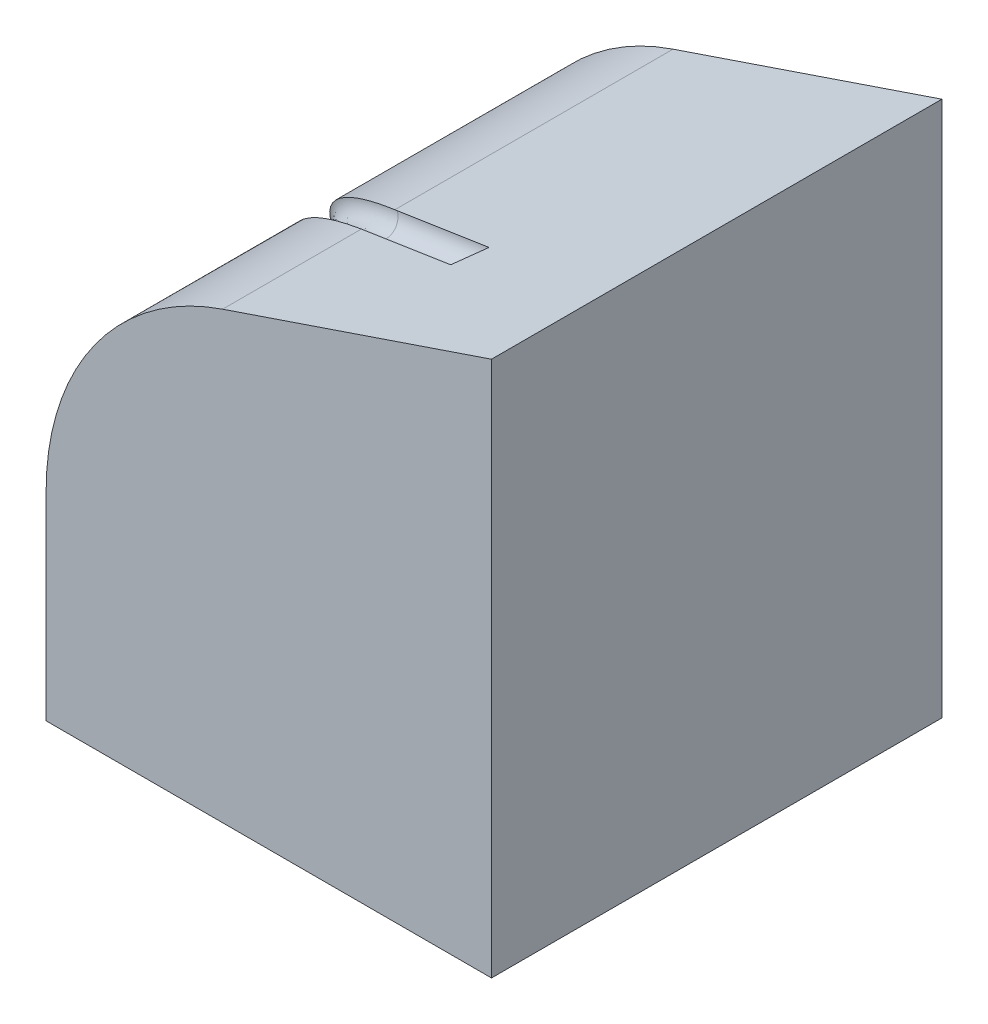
ISO-10303-21;
HEADER;
FILE_DESCRIPTION(('STEP AP214'),'2;1');
FILE_NAME('part.step','',(''),(''),'','','');
FILE_SCHEMA(('AUTOMOTIVE_DESIGN { 1 0 10303 214 1 1 1 1 }'));
ENDSEC;
DATA;
#1=APPLICATION_CONTEXT('core data for automotive mechanical design processes');
#2=APPLICATION_PROTOCOL_DEFINITION('international standard','automotive_design',2000,#1);
#3=PRODUCT_CONTEXT('',#1,'mechanical');
#4=PRODUCT('Part','Part','',(#3));
#5=PRODUCT_RELATED_PRODUCT_CATEGORY('part','',(#4));
#6=PRODUCT_DEFINITION_FORMATION('','',#4);
#7=PRODUCT_DEFINITION_CONTEXT('part definition',#1,'design');
#8=PRODUCT_DEFINITION('design','',#6,#7);
#9=PRODUCT_DEFINITION_SHAPE('','',#8);
#10=(LENGTH_UNIT() NAMED_UNIT(*) SI_UNIT(.MILLI.,.METRE.));
#11=(NAMED_UNIT(*) PLANE_ANGLE_UNIT() SI_UNIT($,.RADIAN.));
#12=(NAMED_UNIT(*) SI_UNIT($,.STERADIAN.) SOLID_ANGLE_UNIT());
#13=UNCERTAINTY_MEASURE_WITH_UNIT(LENGTH_MEASURE(1.E-05),#10,'distance_accuracy_value','');
#14=(GEOMETRIC_REPRESENTATION_CONTEXT(3) GLOBAL_UNCERTAINTY_ASSIGNED_CONTEXT((#13)) GLOBAL_UNIT_ASSIGNED_CONTEXT((#10,
#11,#12)) REPRESENTATION_CONTEXT('',''));
#15=CARTESIAN_POINT('',(0.,0.,0.));
#16=DIRECTION('',(0.,0.,1.));
#17=DIRECTION('',(1.,0.,0.));
#18=AXIS2_PLACEMENT_3D('',#15,#16,#17);
#19=CARTESIAN_POINT('',(-7.12892067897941,26.3531440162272,109.9));
#20=DIRECTION('',(0.,0.,-1.));
#21=DIRECTION('',(-1.,0.,0.));
#22=AXIS2_PLACEMENT_3D('',#19,#20,#21);
#23=CYLINDRICAL_SURFACE('',#22,63.4294971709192);
#24=CARTESIAN_POINT('',(-70.5562406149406,26.8786885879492,37.5910582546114));
#25=CARTESIAN_POINT('',(-70.5569664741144,26.7911047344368,37.5794543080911));
#26=CARTESIAN_POINT('',(-70.5575108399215,26.7035007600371,37.568000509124));
#27=CARTESIAN_POINT('',(-70.5582365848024,26.5282525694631,37.5453932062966));
#28=CARTESIAN_POINT('',(-70.5584179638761,26.4406083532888,37.5342397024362));
#29=CARTESIAN_POINT('',(-70.5584178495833,26.3529440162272,37.5232363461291));
#30=B_SPLINE_CURVE_WITH_KNOTS('',3,(#24,#25,#26,#27,#28,#29),.UNSPECIFIED.,.F.,.F.,(4,2,4),(0.,
0.265053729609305,0.530107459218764),.UNSPECIFIED.);
#31=CARTESIAN_POINT('',(-70.556242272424,26.8784885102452,37.5910317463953));
#32=VERTEX_POINT('',#31);
#33=CARTESIAN_POINT('',(-70.5584178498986,26.3531440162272,37.5232614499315));
#34=VERTEX_POINT('',#33);
#35=EDGE_CURVE('E165',#32,#34,#30,.T.);
#36=ORIENTED_EDGE('',*,*,#35,.F.);
#37=CARTESIAN_POINT('',(-70.556242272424,26.8784885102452,37.5910317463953));
#38=CARTESIAN_POINT('',(-70.5535150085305,27.2078099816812,37.6346610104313));
#39=CARTESIAN_POINT('',(-70.5482243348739,27.5368326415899,37.6803212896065));
#40=CARTESIAN_POINT('',(-70.5325472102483,28.1941577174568,37.7757690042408));
#41=CARTESIAN_POINT('',(-70.5221607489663,28.522460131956,37.8255564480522));
#42=CARTESIAN_POINT('',(-70.4834066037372,29.5060420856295,37.9811976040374));
#43=CARTESIAN_POINT('',(-70.4474436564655,30.160055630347,38.0933379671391));
#44=CARTESIAN_POINT('',(-70.3556155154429,31.4631990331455,38.3344926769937));
#45=CARTESIAN_POINT('',(-70.2997602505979,32.1123311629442,38.4634985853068));
#46=CARTESIAN_POINT('',(-70.1685398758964,33.4050670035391,38.7382222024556));
#47=CARTESIAN_POINT('',(-70.0931746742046,34.0486706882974,38.8839399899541));
#48=CARTESIAN_POINT('',(-69.9233976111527,35.3293311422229,39.1914952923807));
#49=CARTESIAN_POINT('',(-69.8289896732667,35.9663892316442,39.3533294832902));
#50=CARTESIAN_POINT('',(-69.6216007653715,37.2333129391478,39.6924932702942));
#51=CARTESIAN_POINT('',(-69.5086197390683,37.8631785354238,39.8698229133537));
#52=CARTESIAN_POINT('',(-69.2645956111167,39.1150291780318,40.239369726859));
#53=CARTESIAN_POINT('',(-69.1335513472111,39.7370137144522,40.4315878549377));
#54=CARTESIAN_POINT('',(-68.8539622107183,40.9723574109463,40.8305175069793));
#55=CARTESIAN_POINT('',(-68.705417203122,41.5857165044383,41.0372291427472));
#56=CARTESIAN_POINT('',(-68.4623953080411,42.5279608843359,41.3682056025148));
#57=CARTESIAN_POINT('',(-68.3738232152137,42.8601326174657,41.4875105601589));
#58=CARTESIAN_POINT('',(-68.191713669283,43.5215479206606,41.7303736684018));
#59=CARTESIAN_POINT('',(-68.0981761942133,43.8507914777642,41.8539318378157));
#60=CARTESIAN_POINT('',(-67.8102572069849,44.8340239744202,42.2307569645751));
#61=CARTESIAN_POINT('',(-67.6085625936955,45.4835400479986,42.490183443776));
#62=CARTESIAN_POINT('',(-67.1865017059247,46.7699644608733,43.0251643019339));
#63=CARTESIAN_POINT('',(-66.966129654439,47.4068688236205,43.3007236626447));
#64=CARTESIAN_POINT('',(-66.5075899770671,48.6673660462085,43.8670580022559));
#65=CARTESIAN_POINT('',(-66.2694221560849,49.2909587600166,44.1578331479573));
#66=CARTESIAN_POINT('',(-65.7294783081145,50.6409920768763,44.8101930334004));
#67=CARTESIAN_POINT('',(-65.4241902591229,51.3645838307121,45.1747705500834));
#68=CARTESIAN_POINT('',(-64.7909806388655,52.7917010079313,45.9232005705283));
#69=CARTESIAN_POINT('',(-64.4630573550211,53.4952249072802,46.3070545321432));
#70=CARTESIAN_POINT('',(-63.9554969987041,54.5345193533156,46.8967808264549));
#71=CARTESIAN_POINT('',(-63.783751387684,54.8781851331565,47.0956188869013));
#72=CARTESIAN_POINT('',(-63.4351609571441,55.5602506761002,47.497826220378));
#73=CARTESIAN_POINT('',(-63.2583160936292,55.8986503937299,47.7011955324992));
#74=CARTESIAN_POINT('',(-62.8997135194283,56.5701034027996,48.1122245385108));
#75=CARTESIAN_POINT('',(-62.7179566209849,56.9031575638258,48.3198835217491));
#76=CARTESIAN_POINT('',(-62.3496298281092,57.5639986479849,48.7392534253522));
#77=CARTESIAN_POINT('',(-62.163060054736,57.8917857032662,48.9509642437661));
#78=CARTESIAN_POINT('',(-61.9741431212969,58.2169587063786,49.1645708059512));
#79=B_SPLINE_CURVE_WITH_KNOTS('',3,(#37,#38,#39,#40,#41,#42,#43,#44,#45,#46,#47,#48,#49,#50,#51,
#52,#53,#54,#55,#56,#57,#58,#59,#60,#61,#62,#63,#64,#65,#66,#67,#68,#69,#70,#71,#72,#73,#74,#75,
#76,#77,#78),.UNSPECIFIED.,.F.,.F.,(4,2,2,2,2,2,2,2,2,2,2,2,2,2,2,2,2,2,2,2,4),(0.,
0.996597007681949,1.99319603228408,3.98621477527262,5.9782401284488,7.97027485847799,
9.96189957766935,11.9535303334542,13.9452892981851,15.9370636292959,17.0286740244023,
18.1202892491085,20.3034369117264,22.4872623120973,24.6711116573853,27.2679014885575,
29.8648880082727,31.1626046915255,32.4603325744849,33.7578471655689,35.0553291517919),.UNSPECIFIED.);
#80=CARTESIAN_POINT('',(-61.9741431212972,58.2169587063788,49.1645708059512));
#81=VERTEX_POINT('',#80);
#82=EDGE_CURVE('E158',#32,#81,#79,.T.);
#83=ORIENTED_EDGE('',*,*,#82,.T.);
#84=CARTESIAN_POINT('',(-61.9741431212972,58.2169587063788,49.1645708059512));
#85=CARTESIAN_POINT('',(-61.3929715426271,59.2172988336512,49.8216231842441));
#86=CARTESIAN_POINT('',(-60.7822696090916,60.2054475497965,50.4712952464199));
#87=CARTESIAN_POINT('',(-59.5019323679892,62.1543780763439,51.753885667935));
#88=CARTESIAN_POINT('',(-58.8322859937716,63.1151547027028,52.3868008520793));
#89=CARTESIAN_POINT('',(-57.4343356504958,65.0060734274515,53.6336984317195));
#90=CARTESIAN_POINT('',(-56.7060257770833,65.9362124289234,54.2476789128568));
#91=CARTESIAN_POINT('',(-55.1912057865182,67.762383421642,55.4541406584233));
#92=CARTESIAN_POINT('',(-54.4046983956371,68.658417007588,56.0466229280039));
#93=CARTESIAN_POINT('',(-52.7738826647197,70.4130293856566,57.2077718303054));
#94=CARTESIAN_POINT('',(-51.9295605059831,71.2715991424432,57.7764327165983));
#95=CARTESIAN_POINT('',(-50.1841426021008,72.9472672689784,58.8874196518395));
#96=CARTESIAN_POINT('',(-49.2830469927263,73.7643657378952,59.4297457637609));
#97=CARTESIAN_POINT('',(-47.8897635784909,74.9559066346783,60.22133524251));
#98=CARTESIAN_POINT('',(-47.4183086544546,75.3474687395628,60.4815925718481));
#99=CARTESIAN_POINT('',(-46.4616790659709,76.1187213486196,60.9944162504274));
#100=CARTESIAN_POINT('',(-45.9765044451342,76.4984118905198,61.2469826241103));
#101=CARTESIAN_POINT('',(-44.9925961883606,77.2454292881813,61.7439926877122));
#102=CARTESIAN_POINT('',(-44.4938617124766,77.6127553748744,61.9884358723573));
#103=CARTESIAN_POINT('',(-43.4831365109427,78.3344661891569,62.4687841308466));
#104=CARTESIAN_POINT('',(-42.9711456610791,78.6888507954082,62.7046891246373));
#105=CARTESIAN_POINT('',(-41.3308510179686,79.7886393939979,63.4370845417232));
#106=CARTESIAN_POINT('',(-40.1784261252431,80.5093577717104,63.9174838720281));
#107=CARTESIAN_POINT('',(-38.4071877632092,81.5386305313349,64.6045392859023));
#108=CARTESIAN_POINT('',(-37.8096503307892,81.8730995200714,64.8279753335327));
#109=CARTESIAN_POINT('',(-36.6007205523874,82.5241802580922,65.2632459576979));
#110=CARTESIAN_POINT('',(-35.9893281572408,82.8407919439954,65.4750804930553));
#111=CARTESIAN_POINT('',(-34.740346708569,83.4618722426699,65.8908341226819));
#112=CARTESIAN_POINT('',(-34.1024772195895,83.7659492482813,66.0944955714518));
#113=CARTESIAN_POINT('',(-32.8134927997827,84.3540551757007,66.4884046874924));
#114=CARTESIAN_POINT('',(-32.1623780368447,84.6380843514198,66.67865252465));
#115=CARTESIAN_POINT('',(-30.8472834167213,85.1855144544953,67.045253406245));
#116=CARTESIAN_POINT('',(-30.183297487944,85.4489053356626,67.2215996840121));
#117=CARTESIAN_POINT('',(-28.8435601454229,85.9542218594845,67.5599605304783));
#118=CARTESIAN_POINT('',(-28.167807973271,86.1961461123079,67.7219741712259));
#119=CARTESIAN_POINT('',(-27.4866125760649,86.4269776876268,67.8766426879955));
#120=B_SPLINE_CURVE_WITH_KNOTS('',3,(#84,#85,#86,#87,#88,#89,#90,#91,#92,#93,#94,#95,#96,#97,
#98,#99,#100,#101,#102,#103,#104,#105,#106,#107,#108,#109,#110,#111,#112,#113,#114,#115,#116,
#117,#118,#119),.UNSPECIFIED.,.F.,.F.,(4,2,2,2,2,2,2,2,2,2,2,2,2,2,2,2,2,4),(0.,
3.99114734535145,7.98304562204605,11.9753461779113,15.967459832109,19.9605310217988,
23.9535926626,25.9508305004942,27.9480619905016,29.9454174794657,31.9427916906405,
36.263626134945,38.4242142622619,40.5848100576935,42.7905212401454,44.9962044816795,
47.2029548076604,49.409847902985),.UNSPECIFIED.);
#121=CARTESIAN_POINT('',(-27.4866125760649,86.4269776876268,67.8766426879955));
#122=VERTEX_POINT('',#121);
#123=EDGE_CURVE('E77',#81,#122,#120,.T.);
#124=ORIENTED_EDGE('',*,*,#123,.T.);
#125=DIRECTION('',(0.,0.,-1.));
#126=VECTOR('',#125,1.);
#127=CARTESIAN_POINT('',(-27.4866125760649,86.4269776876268,109.9));
#128=LINE('',#127,#126);
#129=CARTESIAN_POINT('',(-27.4866125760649,86.4269776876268,0.));
#130=VERTEX_POINT('',#129);
#131=EDGE_CURVE('E285',#122,#130,#128,.T.);
#132=ORIENTED_EDGE('',*,*,#131,.T.);
#133=CARTESIAN_POINT('',(-7.12892067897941,26.3531440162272,0.));
#134=DIRECTION('',(0.,0.,1.));
#135=DIRECTION('',(-1.,0.,0.));
#136=AXIS2_PLACEMENT_3D('',#133,#134,#135);
#137=CIRCLE('',#136,63.4294971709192);
#138=CARTESIAN_POINT('',(-70.5584178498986,26.3531440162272,0.));
#139=VERTEX_POINT('',#138);
#140=EDGE_CURVE('E322',#130,#139,#137,.T.);
#141=ORIENTED_EDGE('',*,*,#140,.T.);
#142=DIRECTION('',(0.,0.,-1.));
#143=VECTOR('',#142,1.);
#144=CARTESIAN_POINT('',(-70.5584178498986,26.3531440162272,109.9));
#145=LINE('',#144,#143);
#146=EDGE_CURVE('E180',#34,#139,#145,.T.);
#147=ORIENTED_EDGE('',*,*,#146,.F.);
#148=EDGE_LOOP('',(#36,#83,#124,#132,#141,#147));
#149=FACE_BOUND('',#148,.T.);
#150=ADVANCED_FACE('F69',(#149),#23,.T.);
#151=CARTESIAN_POINT('',(-70.5584178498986,-22.1026369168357,109.9));
#152=DIRECTION('',(1.,0.,0.));
#153=DIRECTION('',(0.,0.,-1.));
#154=AXIS2_PLACEMENT_3D('',#151,#152,#153);
#155=PLANE('',#154);
#156=CARTESIAN_POINT('',(-70.5584178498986,16.7215789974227,114.256365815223));
#157=DIRECTION('',(1.,0.,0.));
#158=DIRECTION('',(0.,0.,-1.));
#159=AXIS2_PLACEMENT_3D('',#156,#157,#158);
#160=CIRCLE('',#159,77.3352206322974);
#161=CARTESIAN_POINT('',(-70.5584178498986,-10.7953679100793,41.9822073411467));
#162=VERTEX_POINT('',#161);
#163=EDGE_CURVE('E306',#34,#162,#160,.F.);
#164=ORIENTED_EDGE('',*,*,#163,.F.);
#165=ORIENTED_EDGE('',*,*,#146,.T.);
#166=DIRECTION('',(0.,-1.,0.));
#167=VECTOR('',#166,1.);
#168=CARTESIAN_POINT('',(-70.5584178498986,-22.1026369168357,0.));
#169=LINE('',#168,#167);
#170=CARTESIAN_POINT('',(-70.5584178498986,-22.1026369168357,0.));
#171=VERTEX_POINT('',#170);
#172=EDGE_CURVE('E324',#139,#171,#169,.T.);
#173=ORIENTED_EDGE('',*,*,#172,.T.);
#174=DIRECTION('',(0.,0.,-1.));
#175=VECTOR('',#174,1.);
#176=CARTESIAN_POINT('',(-70.5584178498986,-22.1026369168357,109.9));
#177=LINE('',#176,#175);
#178=CARTESIAN_POINT('',(-70.5584178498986,-22.1026369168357,109.9));
#179=VERTEX_POINT('',#178);
#180=EDGE_CURVE('E334',#179,#171,#177,.T.);
#181=ORIENTED_EDGE('',*,*,#180,.F.);
#182=DIRECTION('',(0.,-1.,0.));
#183=VECTOR('',#182,1.);
#184=CARTESIAN_POINT('',(-70.5584178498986,-22.1026369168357,109.9));
#185=LINE('',#184,#183);
#186=CARTESIAN_POINT('',(-70.5584178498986,26.3531440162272,109.9));
#187=VERTEX_POINT('',#186);
#188=EDGE_CURVE('E92',#187,#179,#185,.T.);
#189=ORIENTED_EDGE('',*,*,#188,.F.);
#190=CARTESIAN_POINT('',(-70.5584178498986,26.3531440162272,45.5931771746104));
#191=VERTEX_POINT('',#190);
#192=EDGE_CURVE('E291',#187,#191,#145,.T.);
#193=ORIENTED_EDGE('',*,*,#192,.T.);
#194=CARTESIAN_POINT('',(-70.5584178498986,26.3531440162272,45.5931771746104));
#195=CARTESIAN_POINT('',(-70.5584178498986,26.2656278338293,45.580966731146));
#196=CARTESIAN_POINT('',(-70.5584178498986,26.1780910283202,45.568907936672));
#197=CARTESIAN_POINT('',(-70.5584178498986,26.0029761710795,45.5450936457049));
#198=CARTESIAN_POINT('',(-70.5584178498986,25.915398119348,45.5333381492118));
#199=CARTESIAN_POINT('',(-70.5584178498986,25.8277994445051,45.521734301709));
#200=B_SPLINE_CURVE_WITH_KNOTS('',3,(#194,#195,#196,#197,#198,#199),.UNSPECIFIED.,.F.,.F.,(4,2,
4),(0.,0.265090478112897,0.530180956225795),.UNSPECIFIED.);
#201=CARTESIAN_POINT('',(-70.5584178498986,25.8277994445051,45.521734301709));
#202=VERTEX_POINT('',#201);
#203=EDGE_CURVE('E259',#191,#202,#200,.T.);
#204=ORIENTED_EDGE('',*,*,#203,.T.);
#205=CARTESIAN_POINT('',(-70.5584178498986,16.7215789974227,114.256365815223));
#206=DIRECTION('',(-1.,0.,0.));
#207=DIRECTION('',(0.,0.,1.));
#208=AXIS2_PLACEMENT_3D('',#205,#206,#207);
#209=CIRCLE('',#208,69.3352206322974);
#210=CARTESIAN_POINT('',(-70.5584178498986,-7.94885666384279,49.4586619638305));
#211=VERTEX_POINT('',#210);
#212=EDGE_CURVE('E173',#211,#202,#209,.F.);
#213=ORIENTED_EDGE('',*,*,#212,.F.);
#214=DIRECTION('',(0.,0.355813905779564,0.934556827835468));
#215=VECTOR('',#214,1.);
#216=CARTESIAN_POINT('',(-70.5584178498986,10.3576810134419,97.541380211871));
#217=LINE('',#216,#215);
#218=EDGE_CURVE('E305',#162,#211,#217,.T.);
#219=ORIENTED_EDGE('',*,*,#218,.F.);
#220=EDGE_LOOP('',(#164,#165,#173,#181,#189,#193,#204,#213,#219));
#221=FACE_BOUND('',#220,.T.);
#222=ADVANCED_FACE('F339',(#221),#155,.F.);
#223=CARTESIAN_POINT('',(38.1192817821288,-22.1026369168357,109.9));
#224=DIRECTION('',(0.,1.,0.));
#225=DIRECTION('',(0.,0.,1.));
#226=AXIS2_PLACEMENT_3D('',#223,#224,#225);
#227=PLANE('',#226);
#228=DIRECTION('',(1.,0.,0.));
#229=VECTOR('',#228,1.);
#230=CARTESIAN_POINT('',(38.1192817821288,-22.1026369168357,0.));
#231=LINE('',#230,#229);
#232=CARTESIAN_POINT('',(38.1192817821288,-22.1026369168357,0.));
#233=VERTEX_POINT('',#232);
#234=EDGE_CURVE('E315',#171,#233,#231,.T.);
#235=ORIENTED_EDGE('',*,*,#234,.T.);
#236=DIRECTION('',(0.,0.,-1.));
#237=VECTOR('',#236,1.);
#238=CARTESIAN_POINT('',(38.1192817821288,-22.1026369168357,109.9));
#239=LINE('',#238,#237);
#240=CARTESIAN_POINT('',(38.1192817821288,-22.1026369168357,109.9));
#241=VERTEX_POINT('',#240);
#242=EDGE_CURVE('E299',#241,#233,#239,.T.);
#243=ORIENTED_EDGE('',*,*,#242,.F.);
#244=DIRECTION('',(1.,0.,0.));
#245=VECTOR('',#244,1.);
#246=CARTESIAN_POINT('',(38.1192817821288,-22.1026369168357,109.9));
#247=LINE('',#246,#245);
#248=EDGE_CURVE('E326',#179,#241,#247,.T.);
#249=ORIENTED_EDGE('',*,*,#248,.F.);
#250=ORIENTED_EDGE('',*,*,#180,.T.);
#251=EDGE_LOOP('',(#235,#243,#249,#250));
#252=FACE_BOUND('',#251,.T.);
#253=ADVANCED_FACE('F71',(#252),#227,.F.);
#254=CARTESIAN_POINT('',(38.1192817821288,108.659362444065,109.9));
#255=DIRECTION('',(-1.,0.,0.));
#256=DIRECTION('',(0.,0.,1.));
#257=AXIS2_PLACEMENT_3D('',#254,#255,#256);
#258=PLANE('',#257);
#259=DIRECTION('',(0.,1.,0.));
#260=VECTOR('',#259,1.);
#261=CARTESIAN_POINT('',(38.1192817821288,108.659362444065,0.));
#262=LINE('',#261,#260);
#263=CARTESIAN_POINT('',(38.1192817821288,108.659362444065,0.));
#264=VERTEX_POINT('',#263);
#265=EDGE_CURVE('E319',#233,#264,#262,.T.);
#266=ORIENTED_EDGE('',*,*,#265,.T.);
#267=DIRECTION('',(0.,0.,-1.));
#268=VECTOR('',#267,1.);
#269=CARTESIAN_POINT('',(38.1192817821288,108.659362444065,109.9));
#270=LINE('',#269,#268);
#271=CARTESIAN_POINT('',(38.1192817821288,108.659362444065,109.9));
#272=VERTEX_POINT('',#271);
#273=EDGE_CURVE('E294',#272,#264,#270,.T.);
#274=ORIENTED_EDGE('',*,*,#273,.F.);
#275=DIRECTION('',(0.,1.,0.));
#276=VECTOR('',#275,1.);
#277=CARTESIAN_POINT('',(38.1192817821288,108.659362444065,109.9));
#278=LINE('',#277,#276);
#279=EDGE_CURVE('E328',#241,#272,#278,.T.);
#280=ORIENTED_EDGE('',*,*,#279,.F.);
#281=ORIENTED_EDGE('',*,*,#242,.T.);
#282=EDGE_LOOP('',(#266,#274,#280,#281));
#283=FACE_BOUND('',#282,.T.);
#284=ADVANCED_FACE('F345',(#283),#258,.F.);
#285=CARTESIAN_POINT('',(-27.4866125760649,86.4269776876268,109.9));
#286=DIRECTION('',(0.320949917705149,-0.947096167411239,0.));
#287=DIRECTION('',(0.947096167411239,0.320949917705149,0.));
#288=AXIS2_PLACEMENT_3D('',#285,#286,#287);
#289=PLANE('',#288);
#290=DIRECTION('',(-0.19213374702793,-0.0651098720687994,0.979206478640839));
#291=VECTOR('',#290,1.);
#292=CARTESIAN_POINT('',(-5.96550755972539,93.7200035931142,114.607667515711));
#293=LINE('',#292,#291);
#294=CARTESIAN_POINT('',(1.94010361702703,96.3990401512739,74.3168503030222));
#295=VERTEX_POINT('',#294);
#296=CARTESIAN_POINT('',(0.403033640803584,95.8781611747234,82.1505021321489));
#297=VERTEX_POINT('',#296);
#298=EDGE_CURVE('E12',#295,#297,#293,.T.);
#299=ORIENTED_EDGE('',*,*,#298,.T.);
#300=DIRECTION('',(0.927402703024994,0.314276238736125,0.20286614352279));
#301=VECTOR('',#300,1.);
#302=CARTESIAN_POINT('',(-28.2551475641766,86.1665381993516,75.881623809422));
#303=LINE('',#302,#301);
#304=CARTESIAN_POINT('',(-27.4866125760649,86.4269776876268,76.049738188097));
#305=VERTEX_POINT('',#304);
#306=EDGE_CURVE('E184',#297,#305,#303,.F.);
#307=ORIENTED_EDGE('',*,*,#306,.T.);
#308=CARTESIAN_POINT('',(-27.4866125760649,86.4269776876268,109.9));
#309=VERTEX_POINT('',#308);
#310=EDGE_CURVE('E290',#309,#305,#128,.T.);
#311=ORIENTED_EDGE('',*,*,#310,.F.);
#312=DIRECTION('',(-0.947096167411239,-0.320949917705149,0.));
#313=VECTOR('',#312,1.);
#314=CARTESIAN_POINT('',(-27.4866125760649,86.4269776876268,109.9));
#315=LINE('',#314,#313);
#316=EDGE_CURVE('E330',#272,#309,#315,.T.);
#317=ORIENTED_EDGE('',*,*,#316,.F.);
#318=ORIENTED_EDGE('',*,*,#273,.T.);
#319=DIRECTION('',(-0.947096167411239,-0.320949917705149,0.));
#320=VECTOR('',#319,1.);
#321=CARTESIAN_POINT('',(-27.4866125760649,86.4269776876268,0.));
#322=LINE('',#321,#320);
#323=EDGE_CURVE('E288',#264,#130,#322,.T.);
#324=ORIENTED_EDGE('',*,*,#323,.T.);
#325=ORIENTED_EDGE('',*,*,#131,.F.);
#326=CARTESIAN_POINT('',(-27.4866125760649,86.4269776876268,67.8766426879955));
#327=CARTESIAN_POINT('',(-27.3586260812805,86.4703494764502,67.9057110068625));
#328=CARTESIAN_POINT('',(-27.2305882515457,86.5137386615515,67.934522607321));
#329=CARTESIAN_POINT('',(-26.9744099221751,86.6005518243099,67.9916323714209));
#330=CARTESIAN_POINT('',(-26.8462694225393,86.643975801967,68.0199305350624));
#331=CARTESIAN_POINT('',(-26.7180775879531,86.687417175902,68.0479719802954));
#332=B_SPLINE_CURVE_WITH_KNOTS('',3,(#326,#327,#328,#329,#330,#331),.UNSPECIFIED.,.F.,.F.,(4,2,
4),(0.,0.414677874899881,0.829355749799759),.UNSPECIFIED.);
#333=CARTESIAN_POINT('',(-26.7180775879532,86.687417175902,68.0479719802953));
#334=VERTEX_POINT('',#333);
#335=EDGE_CURVE('E181',#122,#334,#332,.T.);
#336=ORIENTED_EDGE('',*,*,#335,.T.);
#337=DIRECTION('',(0.927402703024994,0.314276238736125,0.20286614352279));
#338=VECTOR('',#337,1.);
#339=CARTESIAN_POINT('',(-26.7180775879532,86.687417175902,68.0479719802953));
#340=LINE('',#339,#338);
#341=EDGE_CURVE('E283',#334,#295,#340,.T.);
#342=ORIENTED_EDGE('',*,*,#341,.T.);
#343=EDGE_LOOP('',(#299,#307,#311,#317,#318,#324,#325,#336,#342));
#344=FACE_BOUND('',#343,.T.);
#345=ADVANCED_FACE('F282',(#344),#289,.F.);
#346=ORIENTED_EDGE('',*,*,#310,.T.);
#347=CARTESIAN_POINT('',(-27.4866125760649,86.4269776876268,76.049738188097));
#348=CARTESIAN_POINT('',(-27.6147068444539,86.3835693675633,76.0217184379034));
#349=CARTESIAN_POINT('',(-27.7426596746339,86.3397522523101,75.9936987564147));
#350=CARTESIAN_POINT('',(-27.998282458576,86.2513004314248,75.9376595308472));
#351=CARTESIAN_POINT('',(-28.1259524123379,86.2066657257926,75.9096399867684));
#352=CARTESIAN_POINT('',(-28.253480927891,86.1616222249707,75.8816205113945));
#353=B_SPLINE_CURVE_WITH_KNOTS('',3,(#347,#348,#349,#350,#351,#352),.UNSPECIFIED.,.F.,.F.,(4,2,
4),(0.,0.414358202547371,0.828716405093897),.UNSPECIFIED.);
#354=CARTESIAN_POINT('',(-28.253480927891,86.1616222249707,75.8816205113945));
#355=VERTEX_POINT('',#354);
#356=EDGE_CURVE('E220',#305,#355,#353,.T.);
#357=ORIENTED_EDGE('',*,*,#356,.T.);
#358=CARTESIAN_POINT('',(-28.2534809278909,86.1616222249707,75.8816205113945));
#359=CARTESIAN_POINT('',(-28.5611136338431,86.052965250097,75.8140249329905));
#360=CARTESIAN_POINT('',(-28.867605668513,85.9420415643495,75.7449204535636));
#361=CARTESIAN_POINT('',(-29.4782531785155,85.71571202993,75.6038031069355));
#362=CARTESIAN_POINT('',(-29.7824086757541,85.6003062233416,75.5317902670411));
#363=CARTESIAN_POINT('',(-30.6912218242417,85.2474682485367,75.3115693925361));
#364=CARTESIAN_POINT('',(-31.2923016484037,85.003388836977,75.159162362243));
#365=CARTESIAN_POINT('',(-32.4843003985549,84.4980051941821,74.8437998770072));
#366=CARTESIAN_POINT('',(-33.0752199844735,84.2367020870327,74.6808451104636));
#367=CARTESIAN_POINT('',(-34.2464528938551,83.6973353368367,74.3447499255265));
#368=CARTESIAN_POINT('',(-34.8267655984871,83.4192707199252,74.1716089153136));
#369=CARTESIAN_POINT('',(-36.158689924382,82.7560603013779,73.7588333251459));
#370=CARTESIAN_POINT('',(-36.9062054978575,82.3649413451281,73.5155372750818));
#371=CARTESIAN_POINT('',(-38.3806338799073,81.5558504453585,73.0117316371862));
#372=CARTESIAN_POINT('',(-39.1075458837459,81.1378774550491,72.7512213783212));
#373=CARTESIAN_POINT('',(-40.5399356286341,80.2762732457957,72.2136098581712));
#374=CARTESIAN_POINT('',(-41.2454086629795,79.83263645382,71.9365049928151));
#375=CARTESIAN_POINT('',(-42.6339448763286,78.9210442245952,71.3666437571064));
#376=CARTESIAN_POINT('',(-43.317008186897,78.4530889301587,71.0738874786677));
#377=CARTESIAN_POINT('',(-44.6594738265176,77.4945012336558,70.4738098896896));
#378=CARTESIAN_POINT('',(-45.3188951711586,77.0038878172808,70.1665007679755));
#379=CARTESIAN_POINT('',(-46.6141408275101,76.0007979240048,69.5379112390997));
#380=CARTESIAN_POINT('',(-47.2499625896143,75.4883190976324,69.2166293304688));
#381=CARTESIAN_POINT('',(-48.4973219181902,74.4428376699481,68.5609181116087));
#382=CARTESIAN_POINT('',(-49.1088626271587,73.9098377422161,68.22649051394));
#383=CARTESIAN_POINT('',(-50.3072844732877,72.8244642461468,67.5451140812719));
#384=CARTESIAN_POINT('',(-50.894165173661,72.2720903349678,67.19816502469));
#385=CARTESIAN_POINT('',(-52.0882262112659,71.104825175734,66.4645569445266));
#386=CARTESIAN_POINT('',(-52.6933507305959,70.4884413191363,66.0769254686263));
#387=CARTESIAN_POINT('',(-53.8740337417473,69.2359637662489,65.2886996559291));
#388=CARTESIAN_POINT('',(-54.4495918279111,68.5998697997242,64.8881051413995));
#389=CARTESIAN_POINT('',(-55.5709465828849,67.3092444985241,64.0746661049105));
#390=CARTESIAN_POINT('',(-56.1167366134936,66.6547091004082,63.6618188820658));
#391=CARTESIAN_POINT('',(-57.1781741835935,65.3287088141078,62.8247709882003));
#392=CARTESIAN_POINT('',(-57.6938218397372,64.6572439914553,62.4005703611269));
#393=CARTESIAN_POINT('',(-58.7226046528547,63.2609453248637,61.5180538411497));
#394=CARTESIAN_POINT('',(-59.2340204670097,62.5352148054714,61.0591493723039));
#395=CARTESIAN_POINT('',(-60.2230254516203,61.0677008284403,60.1308081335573));
#396=CARTESIAN_POINT('',(-60.7006131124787,60.3259166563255,59.6613708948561));
#397=CARTESIAN_POINT('',(-62.082008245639,58.0792779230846,58.2388588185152));
#398=CARTESIAN_POINT('',(-62.9352317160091,56.5520696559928,57.2709091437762));
#399=CARTESIAN_POINT('',(-63.7640410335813,54.9148980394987,56.2313137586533));
#400=CARTESIAN_POINT('',(-63.8078780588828,54.8278069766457,56.1760056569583));
#401=CARTESIAN_POINT('',(-63.8514991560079,54.7406448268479,56.1206465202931));
#402=B_SPLINE_CURVE_WITH_KNOTS('',3,(#358,#359,#360,#361,#362,#363,#364,#365,#366,#367,#368,
#369,#370,#371,#372,#373,#374,#375,#376,#377,#378,#379,#380,#381,#382,#383,#384,#385,#386,#387,
#388,#389,#390,#391,#392,#393,#394,#395,#396,#397,#398,#399,#400,#401),.UNSPECIFIED.,.F.,.F.,(4,
2,2,2,2,2,2,2,2,2,2,2,2,2,2,2,2,2,2,2,2,4),(0.,0.999532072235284,1.99905476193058,
3.9978548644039,5.99652464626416,7.99531066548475,10.6285521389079,13.2618963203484,
15.8958145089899,18.5297172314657,21.1614516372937,23.7934695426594,26.4251456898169,
29.0568684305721,31.896379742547,34.7359300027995,37.5761109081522,40.4162808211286,
43.41367921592,46.4112112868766,52.4018274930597,52.7381143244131),.UNSPECIFIED.);
#403=CARTESIAN_POINT('',(-63.8514991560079,54.7406448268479,56.1206465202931));
#404=VERTEX_POINT('',#403);
#405=EDGE_CURVE('E226',#355,#404,#402,.T.);
#406=ORIENTED_EDGE('',*,*,#405,.T.);
#407=CARTESIAN_POINT('',(-63.8514991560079,54.7406448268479,56.1206465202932));
#408=CARTESIAN_POINT('',(-63.9804792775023,54.4829216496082,55.9569592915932));
#409=CARTESIAN_POINT('',(-64.1080020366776,54.2237240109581,55.7944516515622));
#410=CARTESIAN_POINT('',(-64.3600873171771,53.7023403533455,55.4719439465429));
#411=CARTESIAN_POINT('',(-64.4846497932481,53.4401542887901,55.3119439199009));
#412=CARTESIAN_POINT('',(-64.8538290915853,52.6490524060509,54.8359270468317));
#413=CARTESIAN_POINT('',(-65.0939310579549,52.1156063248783,54.5239019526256));
#414=CARTESIAN_POINT('',(-65.5617013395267,51.0362829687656,53.9113538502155));
#415=CARTESIAN_POINT('',(-65.789361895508,50.4903982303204,53.6108380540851));
#416=CARTESIAN_POINT('',(-66.1208926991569,49.6627275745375,53.1692173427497));
#417=CARTESIAN_POINT('',(-66.2297439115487,49.3853608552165,53.0235346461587));
#418=CARTESIAN_POINT('',(-66.4440312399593,48.8277516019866,52.7351936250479));
#419=CARTESIAN_POINT('',(-66.5494673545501,48.5475090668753,52.5925353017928));
#420=CARTESIAN_POINT('',(-66.8606161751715,47.7022955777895,52.1690916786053));
#421=CARTESIAN_POINT('',(-67.0610866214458,47.1330450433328,51.8929478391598));
#422=CARTESIAN_POINT('',(-67.4474039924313,45.9834619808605,51.3538137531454));
#423=CARTESIAN_POINT('',(-67.6332508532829,45.4031294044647,51.0908235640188));
#424=CARTESIAN_POINT('',(-67.9896631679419,44.2317868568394,50.5788588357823));
#425=CARTESIAN_POINT('',(-68.1602308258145,43.6407784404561,50.3298822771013));
#426=CARTESIAN_POINT('',(-68.4854766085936,42.4483597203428,49.8468693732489));
#427=CARTESIAN_POINT('',(-68.6401549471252,41.8469495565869,49.6128328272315));
#428=CARTESIAN_POINT('',(-68.8570467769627,40.9486866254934,49.2772525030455));
#429=CARTESIAN_POINT('',(-68.9256378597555,40.6555177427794,49.1698998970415));
#430=CARTESIAN_POINT('',(-69.0588999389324,40.0669983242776,48.9588018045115));
#431=CARTESIAN_POINT('',(-69.1235709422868,39.7716477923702,48.8550563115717));
#432=CARTESIAN_POINT('',(-69.3115864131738,38.8824797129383,48.5491934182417));
#433=CARTESIAN_POINT('',(-69.4289377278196,38.2855275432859,48.3524428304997));
#434=CARTESIAN_POINT('',(-69.6470815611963,37.0840988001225,47.9734838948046));
#435=CARTESIAN_POINT('',(-69.7478759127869,36.4796230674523,47.7912739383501));
#436=CARTESIAN_POINT('',(-69.8862823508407,35.5677631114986,47.529202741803));
#437=CARTESIAN_POINT('',(-69.9302877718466,35.2629456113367,47.4437179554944));
#438=CARTESIAN_POINT('',(-70.0139797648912,34.6516752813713,47.2765668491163));
#439=CARTESIAN_POINT('',(-70.0536663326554,34.3452224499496,47.1949005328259));
#440=CARTESIAN_POINT('',(-70.1679613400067,33.4087942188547,46.9521258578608));
#441=CARTESIAN_POINT('',(-70.2355910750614,32.7762722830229,46.7974356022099));
#442=CARTESIAN_POINT('',(-70.3520469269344,31.5052879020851,46.506453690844));
#443=CARTESIAN_POINT('',(-70.4008733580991,30.8668255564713,46.370161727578));
#444=CARTESIAN_POINT('',(-70.4596939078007,29.9052598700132,46.1799113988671));
#445=CARTESIAN_POINT('',(-70.4769011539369,29.5839767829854,46.1188398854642));
#446=CARTESIAN_POINT('',(-70.5064512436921,28.9403261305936,46.0013808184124));
#447=CARTESIAN_POINT('',(-70.5187940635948,28.61795855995,45.944993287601));
#448=CARTESIAN_POINT('',(-70.5385718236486,27.9722739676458,45.8368014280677));
#449=CARTESIAN_POINT('',(-70.5460062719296,27.6489568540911,45.7849975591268));
#450=CARTESIAN_POINT('',(-70.5559298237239,27.0015728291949,45.6858124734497));
#451=CARTESIAN_POINT('',(-70.5584189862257,26.6775059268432,45.6384312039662));
#452=CARTESIAN_POINT('',(-70.5584178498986,26.3531440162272,45.5931771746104));
#453=B_SPLINE_CURVE_WITH_KNOTS('',3,(#407,#408,#409,#410,#411,#412,#413,#414,#415,#416,#417,
#418,#419,#420,#421,#422,#423,#424,#425,#426,#427,#428,#429,#430,#431,#432,#433,#434,#435,#436,
#437,#438,#439,#440,#441,#442,#443,#444,#445,#446,#447,#448,#449,#450,#451,#452),.UNSPECIFIED.,
.F.,.F.,(4,2,2,2,2,2,2,2,2,2,2,2,2,2,2,2,2,2,2,2,2,2,4),(0.,0.994295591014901,1.98860637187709,
3.97727974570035,5.96717954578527,6.96214763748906,7.95711614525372,9.94779696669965,
11.9384864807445,13.9288883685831,15.9192634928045,16.8781755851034,17.837085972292,
19.7548472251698,21.672396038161,22.631210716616,23.5900263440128,25.5534603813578,
27.5168615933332,28.499266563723,29.4816763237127,30.4641845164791,31.4466809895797),.UNSPECIFIED.);
#454=EDGE_CURVE('E166',#404,#191,#453,.T.);
#455=ORIENTED_EDGE('',*,*,#454,.T.);
#456=ORIENTED_EDGE('',*,*,#192,.F.);
#457=CARTESIAN_POINT('',(-7.12892067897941,26.3531440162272,109.9));
#458=DIRECTION('',(0.,0.,1.));
#459=DIRECTION('',(-1.,0.,0.));
#460=AXIS2_PLACEMENT_3D('',#457,#458,#459);
#461=CIRCLE('',#460,63.4294971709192);
#462=EDGE_CURVE('E332',#309,#187,#461,.T.);
#463=ORIENTED_EDGE('',*,*,#462,.F.);
#464=EDGE_LOOP('',(#346,#357,#406,#455,#456,#463));
#465=FACE_BOUND('',#464,.T.);
#466=ADVANCED_FACE('F202',(#465),#23,.T.);
#467=CARTESIAN_POINT('',(-7.12892067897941,26.3531440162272,109.9));
#468=DIRECTION('',(0.,0.,-1.));
#469=DIRECTION('',(-1.,0.,0.));
#470=AXIS2_PLACEMENT_3D('',#467,#468,#469);
#471=PLANE('',#470);
#472=ORIENTED_EDGE('',*,*,#248,.T.);
#473=ORIENTED_EDGE('',*,*,#279,.T.);
#474=ORIENTED_EDGE('',*,*,#316,.T.);
#475=ORIENTED_EDGE('',*,*,#462,.T.);
#476=ORIENTED_EDGE('',*,*,#188,.T.);
#477=EDGE_LOOP('',(#472,#473,#474,#475,#476));
#478=FACE_BOUND('',#477,.T.);
#479=ADVANCED_FACE('F343',(#478),#471,.F.);
#480=CARTESIAN_POINT('',(-7.12892067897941,26.3531440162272,0.));
#481=DIRECTION('',(0.,0.,-1.));
#482=DIRECTION('',(-1.,0.,0.));
#483=AXIS2_PLACEMENT_3D('',#480,#481,#482);
#484=PLANE('',#483);
#485=ORIENTED_EDGE('',*,*,#234,.F.);
#486=ORIENTED_EDGE('',*,*,#172,.F.);
#487=ORIENTED_EDGE('',*,*,#140,.F.);
#488=ORIENTED_EDGE('',*,*,#323,.F.);
#489=ORIENTED_EDGE('',*,*,#265,.F.);
#490=EDGE_LOOP('',(#485,#486,#487,#488,#489));
#491=FACE_BOUND('',#490,.T.);
#492=ADVANCED_FACE('F217',(#491),#484,.T.);
#493=CARTESIAN_POINT('',(1.17156862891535,96.1386006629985,78.2336762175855));
#494=DIRECTION('',(0.927402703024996,0.314276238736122,0.202866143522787));
#495=DIRECTION('',(-0.059931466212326,-0.410486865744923,0.909894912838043));
#496=AXIS2_PLACEMENT_3D('',#493,#494,#495);
#497=PLANE('',#496);
#498=CARTESIAN_POINT('',(1.17156862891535,96.1386006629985,78.2336762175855));
#499=DIRECTION('',(0.927402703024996,0.314276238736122,0.202866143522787));
#500=DIRECTION('',(-0.059931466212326,-0.410486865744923,0.909894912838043));
#501=AXIS2_PLACEMENT_3D('',#498,#499,#500);
#502=CIRCLE('',#501,4.00000000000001);
#503=EDGE_CURVE('E175',#297,#295,#502,.T.);
#504=ORIENTED_EDGE('',*,*,#503,.F.);
#505=ORIENTED_EDGE('',*,*,#298,.F.);
#506=EDGE_LOOP('',(#504,#505));
#507=FACE_BOUND('',#506,.T.);
#508=ADVANCED_FACE('F215',(#507),#497,.F.);
#509=CARTESIAN_POINT('',(-27.4866125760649,86.4269776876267,71.9647978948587));
#510=DIRECTION('',(0.927402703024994,0.314276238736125,0.20286614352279));
#511=DIRECTION('',(-0.320949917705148,0.947096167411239,0.));
#512=AXIS2_PLACEMENT_3D('',#509,#510,#511);
#513=CYLINDRICAL_SURFACE('',#512,4.00000000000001);
#514=CARTESIAN_POINT('',(-27.4866125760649,86.4269776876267,71.9647978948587));
#515=DIRECTION('',(0.927402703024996,0.314276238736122,0.202866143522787));
#516=DIRECTION('',(-0.059931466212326,-0.410486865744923,0.909894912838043));
#517=AXIS2_PLACEMENT_3D('',#514,#515,#516);
#518=CIRCLE('',#517,4.00000000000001);
#519=EDGE_CURVE('E275',#355,#334,#518,.T.);
#520=ORIENTED_EDGE('',*,*,#519,.F.);
#521=ORIENTED_EDGE('',*,*,#356,.F.);
#522=ORIENTED_EDGE('',*,*,#306,.F.);
#523=ORIENTED_EDGE('',*,*,#503,.T.);
#524=ORIENTED_EDGE('',*,*,#341,.F.);
#525=EDGE_LOOP('',(#520,#521,#522,#523,#524));
#526=FACE_BOUND('',#525,.T.);
#527=ADVANCED_FACE('F211',(#526),#513,.F.);
#528=CARTESIAN_POINT('',(-63.5234987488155,54.5746010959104,56.1034656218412));
#529=CARTESIAN_POINT('',(-61.4387008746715,58.4350365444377,58.5953869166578));
#530=CARTESIAN_POINT('',(-56.3626204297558,65.8949562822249,63.4107848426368));
#531=CARTESIAN_POINT('',(-47.2428048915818,74.5829128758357,69.0188838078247));
#532=CARTESIAN_POINT('',(-37.4936208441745,80.8754789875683,73.0807518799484));
#533=CARTESIAN_POINT('',(-30.9820725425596,83.6817340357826,74.8921969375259));
#534=CARTESIAN_POINT('',(-27.7263384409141,84.7850302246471,75.6043775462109));
#535=CARTESIAN_POINT('',(-56.3324283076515,51.1382109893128,55.4108409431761));
#536=CARTESIAN_POINT('',(-54.2986704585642,54.9041352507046,57.8417550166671));
#537=CARTESIAN_POINT('',(-49.9260472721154,61.2167763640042,61.9165815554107));
#538=CARTESIAN_POINT('',(-41.8142849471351,69.0509907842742,66.97358768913));
#539=CARTESIAN_POINT('',(-33.0797428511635,74.5980792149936,70.5542479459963));
#540=CARTESIAN_POINT('',(-27.920165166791,76.870373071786,72.0210196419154));
#541=CARTESIAN_POINT('',(-24.7724805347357,77.9370536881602,72.7095648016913));
#542=CARTESIAN_POINT('',(-55.1652187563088,54.9758532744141,48.4891270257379));
#543=CARTESIAN_POINT('',(-53.1314609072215,58.7417775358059,50.9200410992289));
#544=CARTESIAN_POINT('',(-48.884292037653,64.8459735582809,54.8603157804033));
#545=CARTESIAN_POINT('',(-40.9351998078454,72.549018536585,59.8326516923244));
#546=CARTESIAN_POINT('',(-32.3554469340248,77.9769416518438,63.3363904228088));
#547=CARTESIAN_POINT('',(-27.4407134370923,80.1542679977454,64.741860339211));
#548=CARTESIAN_POINT('',(-24.2930288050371,81.2209486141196,65.430405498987));
#549=CARTESIAN_POINT('',(-62.3562891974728,58.4122433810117,49.1817517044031));
#550=CARTESIAN_POINT('',(-60.2970113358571,62.2254232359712,51.6431693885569));
#551=CARTESIAN_POINT('',(-55.3116575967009,69.5453640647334,56.3682105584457));
#552=CARTESIAN_POINT('',(-46.3574410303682,78.0793415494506,61.8769156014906));
#553=CARTESIAN_POINT('',(-36.793546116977,84.247086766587,65.8582114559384));
#554=CARTESIAN_POINT('',(-30.4485960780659,86.9839367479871,67.6248553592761));
#555=CARTESIAN_POINT('',(-27.2468867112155,88.0689251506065,68.3252182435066));
#556=CARTESIAN_POINT('',(-69.5473596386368,61.8486334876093,49.8743763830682));
#557=CARTESIAN_POINT('',(-67.4625617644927,65.7090689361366,52.3662976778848));
#558=CARTESIAN_POINT('',(-61.7390231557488,74.244754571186,57.8761053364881));
#559=CARTESIAN_POINT('',(-51.779682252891,83.6096645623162,63.9211795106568));
#560=CARTESIAN_POINT('',(-41.2316452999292,90.5172318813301,68.380032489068));
#561=CARTESIAN_POINT('',(-33.4564787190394,93.8136054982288,70.5078503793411));
#562=CARTESIAN_POINT('',(-30.200744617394,94.9169016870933,71.2200309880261));
#563=CARTESIAN_POINT('',(-70.7145691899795,58.010991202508,56.7960903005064));
#564=CARTESIAN_POINT('',(-68.5787312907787,61.9659378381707,59.3490188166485));
#565=CARTESIAN_POINT('',(-62.7991935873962,70.5731362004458,64.904988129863));
#566=CARTESIAN_POINT('',(-52.6713248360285,80.114834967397,71.0641799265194));
#567=CARTESIAN_POINT('',(-41.9074988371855,87.1528787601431,75.6072558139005));
#568=CARTESIAN_POINT('',(-34.0439799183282,90.4930949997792,77.7633742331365));
#569=CARTESIAN_POINT('',(-30.6801963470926,91.6330067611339,78.4991902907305));
#570=CARTESIAN_POINT('',(-63.5234987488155,54.5746010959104,56.1034656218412));
#571=CARTESIAN_POINT('',(-61.4387008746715,58.4350365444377,58.5953869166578));
#572=CARTESIAN_POINT('',(-56.3626204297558,65.8949562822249,63.4107848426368));
#573=CARTESIAN_POINT('',(-47.2428048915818,74.5829128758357,69.0188838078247));
#574=CARTESIAN_POINT('',(-37.4936208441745,80.8754789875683,73.0807518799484));
#575=CARTESIAN_POINT('',(-30.9820725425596,83.6817340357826,74.8921969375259));
#576=CARTESIAN_POINT('',(-27.7263384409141,84.7850302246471,75.6043775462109));
#577=(BOUNDED_SURFACE() B_SPLINE_SURFACE(3,3,((#528,#529,#530,#531,#532,#533,#534),(#535,#536,
#537,#538,#539,#540,#541),(#542,#543,#544,#545,#546,#547,#548),(#549,#550,#551,#552,#553,#554,
#555),(#556,#557,#558,#559,#560,#561,#562),(#563,#564,#565,#566,#567,#568,#569),(#570,#571,#572,
#573,#574,#575,#576)),.UNSPECIFIED.,.T.,.F.,.F.) B_SPLINE_SURFACE_WITH_KNOTS((4,3,4),(4,1,1,1,
4),(0.,0.5,1.),(0.,0.28,0.559999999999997,0.78,1.),
.UNSPECIFIED.) GEOMETRIC_REPRESENTATION_ITEM() RATIONAL_B_SPLINE_SURFACE(((1.,1.,1.,1.,1.,1.,
1.),(0.333333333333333,0.333333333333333,0.333333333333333,0.333333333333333,0.333333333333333,
0.333333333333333,0.333333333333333),(0.333333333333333,0.333333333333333,0.333333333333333,
0.333333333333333,0.333333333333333,0.333333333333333,0.333333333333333),(1.,1.,1.,1.,1.,1.,1.),
(0.333333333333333,0.333333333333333,0.333333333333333,0.333333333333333,0.333333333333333,
0.333333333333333,0.333333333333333),(0.333333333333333,0.333333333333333,0.333333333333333,
0.333333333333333,0.333333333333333,0.333333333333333,0.333333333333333),(1.,1.,1.,1.,1.,1.,1.))) REPRESENTATION_ITEM('') SURFACE());
#578=CARTESIAN_POINT('',(-62.9398939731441,56.4934222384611,52.6426086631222));
#579=DIRECTION('',(0.413183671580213,0.765095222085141,0.493870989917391));
#580=DIRECTION('',(-0.14590119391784,-0.479705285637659,0.865214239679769));
#581=AXIS2_PLACEMENT_3D('',#578,#579,#580);
#582=CIRCLE('',#581,4.00000000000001);
#583=EDGE_CURVE('E161',#404,#81,#582,.T.);
#584=ORIENTED_EDGE('',*,*,#123,.F.);
#585=ORIENTED_EDGE('',*,*,#583,.F.);
#586=ORIENTED_EDGE('',*,*,#405,.F.);
#587=ORIENTED_EDGE('',*,*,#519,.T.);
#588=ORIENTED_EDGE('',*,*,#335,.F.);
#589=EDGE_LOOP('',(#584,#585,#586,#587,#588));
#590=FACE_BOUND('',#589,.T.);
#591=ADVANCED_FACE('F210',(#590),#577,.F.);
#592=CARTESIAN_POINT('',(-70.5584178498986,16.7215789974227,114.256365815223));
#593=DIRECTION('',(-1.,0.,0.));
#594=DIRECTION('',(0.,0.,1.));
#595=AXIS2_PLACEMENT_3D('',#592,#593,#594);
#596=TOROIDAL_SURFACE('',#595,73.3352206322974,4.00000000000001);
#597=ORIENTED_EDGE('',*,*,#35,.T.);
#598=ORIENTED_EDGE('',*,*,#163,.T.);
#599=CARTESIAN_POINT('',(-70.5584178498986,-9.37211228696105,45.7204346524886));
#600=DIRECTION('',(0.,0.934556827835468,-0.355813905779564));
#601=DIRECTION('',(0.,0.355813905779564,0.934556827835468));
#602=AXIS2_PLACEMENT_3D('',#599,#600,#601);
#603=CIRCLE('',#602,4.00000000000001);
#604=EDGE_CURVE('E176',#211,#162,#603,.T.);
#605=ORIENTED_EDGE('',*,*,#604,.F.);
#606=ORIENTED_EDGE('',*,*,#212,.T.);
#607=CARTESIAN_POINT('',(-70.5584178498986,26.3531440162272,41.5563827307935));
#608=DIRECTION('',(0.,0.991337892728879,0.131336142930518));
#609=DIRECTION('',(0.,-0.131336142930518,0.991337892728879));
#610=AXIS2_PLACEMENT_3D('',#607,#608,#609);
#611=CIRCLE('',#610,4.00000000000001);
#612=EDGE_CURVE('E84',#202,#32,#611,.T.);
#613=ORIENTED_EDGE('',*,*,#612,.T.);
#614=EDGE_LOOP('',(#597,#598,#605,#606,#613));
#615=FACE_BOUND('',#614,.T.);
#616=ADVANCED_FACE('F169',(#615),#596,.F.);
#617=CARTESIAN_POINT('',(-70.5584178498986,-9.37211228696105,45.7204346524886));
#618=DIRECTION('',(0.,0.934556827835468,-0.355813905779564));
#619=DIRECTION('',(0.,0.355813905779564,0.934556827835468));
#620=AXIS2_PLACEMENT_3D('',#617,#618,#619);
#621=PLANE('',#620);
#622=ORIENTED_EDGE('',*,*,#218,.T.);
#623=ORIENTED_EDGE('',*,*,#604,.T.);
#624=EDGE_LOOP('',(#622,#623));
#625=FACE_BOUND('',#624,.T.);
#626=ADVANCED_FACE('F209',(#625),#621,.T.);
#627=CARTESIAN_POINT('',(-70.5584178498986,25.8277994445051,45.521734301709));
#628=CARTESIAN_POINT('',(-70.5584178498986,28.6214288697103,45.8918447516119));
#629=CARTESIAN_POINT('',(-70.425313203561,31.1291604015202,46.3787004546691));
#630=CARTESIAN_POINT('',(-70.0923684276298,33.9211440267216,47.0847510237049));
#631=CARTESIAN_POINT('',(-69.7747303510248,36.4144262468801,47.7332788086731));
#632=CARTESIAN_POINT('',(-69.2848093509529,38.9356064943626,48.5336705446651));
#633=CARTESIAN_POINT('',(-68.5885751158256,41.6753190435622,49.5551341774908));
#634=CARTESIAN_POINT('',(-67.8542380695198,44.3897076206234,50.6084449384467));
#635=CARTESIAN_POINT('',(-66.2325444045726,48.9970683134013,52.7496416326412));
#636=CARTESIAN_POINT('',(-64.5453475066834,52.6824362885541,54.8820682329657));
#637=CARTESIAN_POINT('',(-63.5234987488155,54.5746010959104,56.1034656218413));
#638=CARTESIAN_POINT('',(-62.5584178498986,25.8277994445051,45.521734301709));
#639=CARTESIAN_POINT('',(-62.5584178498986,29.0646468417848,45.950563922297));
#640=CARTESIAN_POINT('',(-62.4444939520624,30.7986186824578,46.4014670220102));
#641=CARTESIAN_POINT('',(-62.1628411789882,32.9112852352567,47.0495897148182));
#642=CARTESIAN_POINT('',(-61.8941934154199,34.8181015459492,47.6445039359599));
#643=CARTESIAN_POINT('',(-61.4807706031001,37.0861469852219,48.3849817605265));
#644=CARTESIAN_POINT('',(-60.8606230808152,39.6003055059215,49.3441929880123));
#645=CARTESIAN_POINT('',(-60.1997569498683,42.1049464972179,50.33657439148));
#646=CARTESIAN_POINT('',(-58.6647132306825,46.3017670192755,52.3868499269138));
#647=CARTESIAN_POINT('',(-57.4781575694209,49.016655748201,54.0413714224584));
#648=CARTESIAN_POINT('',(-56.3324283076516,51.1382109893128,55.4108409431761));
#649=CARTESIAN_POINT('',(-62.5584178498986,26.8784885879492,37.591031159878));
#650=CARTESIAN_POINT('',(-62.5584178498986,30.115335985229,38.0198607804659));
#651=CARTESIAN_POINT('',(-62.3435028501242,32.3056754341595,38.5483900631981));
#652=CARTESIAN_POINT('',(-61.9432555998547,34.8427603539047,39.291635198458));
#653=CARTESIAN_POINT('',(-61.5681322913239,37.1192309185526,39.9723567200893));
#654=CARTESIAN_POINT('',(-61.0548684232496,39.6154531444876,40.7975078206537));
#655=CARTESIAN_POINT('',(-60.3311143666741,42.3556313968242,41.8505235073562));
#656=CARTESIAN_POINT('',(-59.5688822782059,45.0782362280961,42.9364285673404));
#657=CARTESIAN_POINT('',(-57.8725385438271,49.6652664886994,45.151425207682));
#658=CARTESIAN_POINT('',(-56.3109480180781,52.8542980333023,47.1196575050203));
#659=CARTESIAN_POINT('',(-55.1652187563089,54.9758532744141,48.4891270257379));
#660=CARTESIAN_POINT('',(-70.5584178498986,26.8784885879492,37.591031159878));
#661=CARTESIAN_POINT('',(-70.5584178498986,29.8937269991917,37.9905011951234));
#662=CARTESIAN_POINT('',(-70.3230651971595,32.7386078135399,38.5403826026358));
#663=CARTESIAN_POINT('',(-69.8724811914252,35.8686451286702,39.3292062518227));
#664=CARTESIAN_POINT('',(-69.4494736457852,38.659523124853,40.0529440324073));
#665=CARTESIAN_POINT('',(-68.8633314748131,41.4248808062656,40.9366901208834));
#666=CARTESIAN_POINT('',(-68.0612624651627,44.4182966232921,42.0577425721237));
#667=CARTESIAN_POINT('',(-67.2216178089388,47.3809951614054,43.2123417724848));
#668=CARTESIAN_POINT('',(-65.4118772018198,52.4071985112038,45.5474615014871));
#669=CARTESIAN_POINT('',(-63.4400782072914,56.4053833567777,47.8863182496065));
#670=CARTESIAN_POINT('',(-62.3562891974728,58.4122433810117,49.1817517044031));
#671=CARTESIAN_POINT('',(-78.5584178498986,26.8784885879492,37.591031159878));
#672=CARTESIAN_POINT('',(-78.5584178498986,29.6721180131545,37.9611416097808));
#673=CARTESIAN_POINT('',(-78.3026275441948,33.1715401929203,38.5323751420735));
#674=CARTESIAN_POINT('',(-77.8017067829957,36.8945299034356,39.3667773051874));
#675=CARTESIAN_POINT('',(-77.3308150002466,40.1998153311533,40.1335313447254));
#676=CARTESIAN_POINT('',(-76.6717945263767,43.2343084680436,41.0758724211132));
#677=CARTESIAN_POINT('',(-75.7914105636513,46.4809618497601,42.2649616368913));
#678=CARTESIAN_POINT('',(-74.8743533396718,49.6837540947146,43.4882549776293));
#679=CARTESIAN_POINT('',(-72.9512158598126,55.1491305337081,45.9434977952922));
#680=CARTESIAN_POINT('',(-70.5692083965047,59.956468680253,48.6529789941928));
#681=CARTESIAN_POINT('',(-69.5473596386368,61.8486334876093,49.8743763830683));
#682=CARTESIAN_POINT('',(-78.5584178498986,25.8277994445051,45.521734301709));
#683=CARTESIAN_POINT('',(-78.5584178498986,28.1782108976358,45.8331255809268));
#684=CARTESIAN_POINT('',(-78.4061324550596,31.4597021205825,46.355933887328));
#685=CARTESIAN_POINT('',(-78.0218956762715,34.9310028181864,47.1199123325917));
#686=CARTESIAN_POINT('',(-77.6552672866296,38.0107509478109,47.8220536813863));
#687=CARTESIAN_POINT('',(-77.0888480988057,40.7850660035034,48.6823593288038));
#688=CARTESIAN_POINT('',(-76.316527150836,43.7503325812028,49.7660753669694));
#689=CARTESIAN_POINT('',(-75.5087191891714,46.6744687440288,50.8803154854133));
#690=CARTESIAN_POINT('',(-73.8003755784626,51.6923696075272,53.1124333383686));
#691=CARTESIAN_POINT('',(-71.612537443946,56.3482168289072,55.7227650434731));
#692=CARTESIAN_POINT('',(-70.7145691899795,58.0109912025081,56.7960903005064));
#693=CARTESIAN_POINT('',(-70.5584178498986,25.8277994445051,45.521734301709));
#694=CARTESIAN_POINT('',(-70.5584178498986,28.6214288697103,45.8918447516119));
#695=CARTESIAN_POINT('',(-70.425313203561,31.1291604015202,46.3787004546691));
#696=CARTESIAN_POINT('',(-70.0923684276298,33.9211440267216,47.0847510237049));
#697=CARTESIAN_POINT('',(-69.7747303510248,36.4144262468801,47.7332788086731));
#698=CARTESIAN_POINT('',(-69.2848093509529,38.9356064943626,48.5336705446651));
#699=CARTESIAN_POINT('',(-68.5885751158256,41.6753190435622,49.5551341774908));
#700=CARTESIAN_POINT('',(-67.8542380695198,44.3897076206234,50.6084449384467));
#701=CARTESIAN_POINT('',(-66.2325444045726,48.9970683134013,52.7496416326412));
#702=CARTESIAN_POINT('',(-64.5453475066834,52.6824362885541,54.8820682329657));
#703=CARTESIAN_POINT('',(-63.5234987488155,54.5746010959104,56.1034656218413));
#704=(BOUNDED_SURFACE() B_SPLINE_SURFACE(3,3,((#627,#628,#629,#630,#631,#632,#633,#634,#635,
#636,#637),(#638,#639,#640,#641,#642,#643,#644,#645,#646,#647,#648),(#649,#650,#651,#652,#653,
#654,#655,#656,#657,#658,#659),(#660,#661,#662,#663,#664,#665,#666,#667,#668,#669,#670),(#671,
#672,#673,#674,#675,#676,#677,#678,#679,#680,#681),(#682,#683,#684,#685,#686,#687,#688,#689,
#690,#691,#692),(#693,#694,#695,#696,#697,#698,#699,#700,#701,#702,#703)),.UNSPECIFIED.,.T.,.F.,
.F.) B_SPLINE_SURFACE_WITH_KNOTS((4,3,4),(4,2,1,2,1,1,4),(0.,0.5,1.),(0.,0.25,0.28,0.5,0.56,
0.780000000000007,1.),
.UNSPECIFIED.) GEOMETRIC_REPRESENTATION_ITEM() RATIONAL_B_SPLINE_SURFACE(((1.,1.,1.,1.,1.,1.,1.,
1.,1.,1.,1.),(0.333333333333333,0.333333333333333,0.333333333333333,0.333333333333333,
0.333333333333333,0.333333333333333,0.333333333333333,0.333333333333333,0.333333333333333,
0.333333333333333,0.333333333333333),(0.333333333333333,0.333333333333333,0.333333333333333,
0.333333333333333,0.333333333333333,0.333333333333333,0.333333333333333,0.333333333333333,
0.333333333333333,0.333333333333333,0.333333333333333),(1.,1.,1.,1.,1.,1.,1.,1.,1.,1.,1.),
(0.333333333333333,0.333333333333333,0.333333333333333,0.333333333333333,0.333333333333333,
0.333333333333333,0.333333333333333,0.333333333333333,0.333333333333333,0.333333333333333,
0.333333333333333),(0.333333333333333,0.333333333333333,0.333333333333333,0.333333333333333,
0.333333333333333,0.333333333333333,0.333333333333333,0.333333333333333,0.333333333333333,
0.333333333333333,0.333333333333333),(1.,1.,1.,1.,1.,1.,1.,1.,1.,1.,1.))) REPRESENTATION_ITEM('') SURFACE());
#705=ORIENTED_EDGE('',*,*,#612,.F.);
#706=ORIENTED_EDGE('',*,*,#203,.F.);
#707=ORIENTED_EDGE('',*,*,#454,.F.);
#708=ORIENTED_EDGE('',*,*,#583,.T.);
#709=ORIENTED_EDGE('',*,*,#82,.F.);
#710=EDGE_LOOP('',(#705,#706,#707,#708,#709));
#711=FACE_BOUND('',#710,.T.);
#712=ADVANCED_FACE('F159',(#711),#704,.F.);
#713=CLOSED_SHELL('',(#150,#222,#253,#284,#345,#466,#479,#492,#508,#527,#591,#616,#626,#712));
#714=MANIFOLD_SOLID_BREP('B2',#713);
#715=ADVANCED_BREP_SHAPE_REPRESENTATION('',(#18,#714),#14);
#716=SHAPE_DEFINITION_REPRESENTATION(#9,#715);
ENDSEC;
END-ISO-10303-21;
